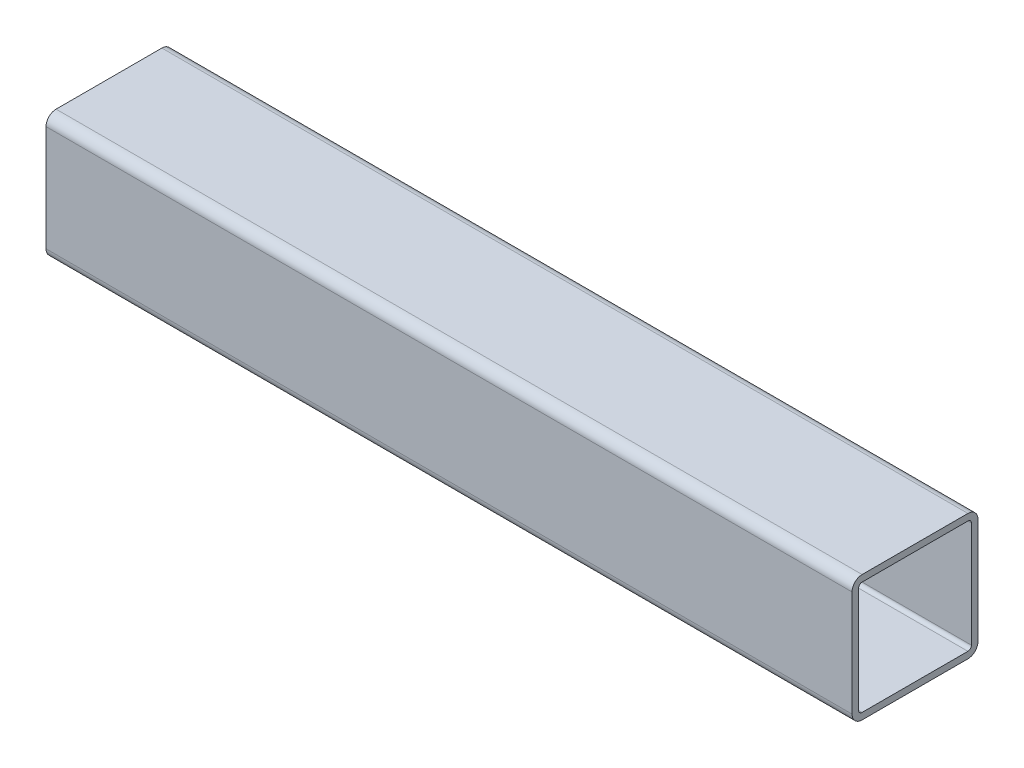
ISO-10303-21;
HEADER;
FILE_DESCRIPTION(('STEP AP214'),'2;1');
FILE_NAME('part.step','',(''),(''),'','','');
FILE_SCHEMA(('AUTOMOTIVE_DESIGN { 1 0 10303 214 1 1 1 1 }'));
ENDSEC;
DATA;
#1=APPLICATION_CONTEXT('core data for automotive mechanical design processes');
#2=APPLICATION_PROTOCOL_DEFINITION('international standard','automotive_design',2000,#1);
#3=PRODUCT_CONTEXT('',#1,'mechanical');
#4=PRODUCT('Part','Part','',(#3));
#5=PRODUCT_RELATED_PRODUCT_CATEGORY('part','',(#4));
#6=PRODUCT_DEFINITION_FORMATION('','',#4);
#7=PRODUCT_DEFINITION_CONTEXT('part definition',#1,'design');
#8=PRODUCT_DEFINITION('design','',#6,#7);
#9=PRODUCT_DEFINITION_SHAPE('','',#8);
#10=(LENGTH_UNIT() NAMED_UNIT(*) SI_UNIT(.MILLI.,.METRE.));
#11=(NAMED_UNIT(*) PLANE_ANGLE_UNIT() SI_UNIT($,.RADIAN.));
#12=(NAMED_UNIT(*) SI_UNIT($,.STERADIAN.) SOLID_ANGLE_UNIT());
#13=UNCERTAINTY_MEASURE_WITH_UNIT(LENGTH_MEASURE(1.E-05),#10,'distance_accuracy_value','');
#14=(GEOMETRIC_REPRESENTATION_CONTEXT(3) GLOBAL_UNCERTAINTY_ASSIGNED_CONTEXT((#13)) GLOBAL_UNIT_ASSIGNED_CONTEXT((#10,
#11,#12)) REPRESENTATION_CONTEXT('',''));
#15=CARTESIAN_POINT('',(0.,0.,0.));
#16=DIRECTION('',(0.,0.,1.));
#17=DIRECTION('',(1.,0.,0.));
#18=AXIS2_PLACEMENT_3D('',#15,#16,#17);
#19=CARTESIAN_POINT('',(203.2,2.54,29.21));
#20=DIRECTION('',(1.,0.,0.));
#21=DIRECTION('',(0.,0.,-1.));
#22=AXIS2_PLACEMENT_3D('',#19,#20,#21);
#23=PLANE('',#22);
#24=CARTESIAN_POINT('',(203.2,2.54,29.21));
#25=DIRECTION('',(1.,0.,0.));
#26=DIRECTION('',(0.,0.,-1.));
#27=AXIS2_PLACEMENT_3D('',#24,#25,#26);
#28=CIRCLE('',#27,2.54);
#29=CARTESIAN_POINT('',(203.2,2.54000000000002,31.75));
#30=VERTEX_POINT('',#29);
#31=CARTESIAN_POINT('',(203.2,0.,29.21));
#32=VERTEX_POINT('',#31);
#33=EDGE_CURVE('E217',#30,#32,#28,.T.);
#34=ORIENTED_EDGE('',*,*,#33,.T.);
#35=DIRECTION('',(0.,0.,-1.));
#36=VECTOR('',#35,1.);
#37=CARTESIAN_POINT('',(203.2,0.,29.21));
#38=LINE('',#37,#36);
#39=CARTESIAN_POINT('',(203.2,0.,2.54000000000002));
#40=VERTEX_POINT('',#39);
#41=EDGE_CURVE('E220',#32,#40,#38,.T.);
#42=ORIENTED_EDGE('',*,*,#41,.T.);
#43=CARTESIAN_POINT('',(203.2,2.54,2.54));
#44=DIRECTION('',(1.,0.,0.));
#45=DIRECTION('',(0.,0.,1.));
#46=AXIS2_PLACEMENT_3D('',#43,#44,#45);
#47=CIRCLE('',#46,2.54);
#48=CARTESIAN_POINT('',(203.2,2.54000000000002,0.));
#49=VERTEX_POINT('',#48);
#50=EDGE_CURVE('E223',#40,#49,#47,.T.);
#51=ORIENTED_EDGE('',*,*,#50,.T.);
#52=DIRECTION('',(0.,1.,0.));
#53=VECTOR('',#52,1.);
#54=CARTESIAN_POINT('',(203.2,2.54000000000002,0.));
#55=LINE('',#54,#53);
#56=CARTESIAN_POINT('',(203.2,29.21,0.));
#57=VERTEX_POINT('',#56);
#58=EDGE_CURVE('E225',#49,#57,#55,.T.);
#59=ORIENTED_EDGE('',*,*,#58,.T.);
#60=CARTESIAN_POINT('',(203.2,29.21,2.54));
#61=DIRECTION('',(1.,0.,0.));
#62=DIRECTION('',(0.,0.,-1.));
#63=AXIS2_PLACEMENT_3D('',#60,#61,#62);
#64=CIRCLE('',#63,2.54);
#65=CARTESIAN_POINT('',(203.2,31.75,2.54000000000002));
#66=VERTEX_POINT('',#65);
#67=EDGE_CURVE('E227',#57,#66,#64,.T.);
#68=ORIENTED_EDGE('',*,*,#67,.T.);
#69=DIRECTION('',(0.,0.,1.));
#70=VECTOR('',#69,1.);
#71=CARTESIAN_POINT('',(203.2,31.75,2.54000000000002));
#72=LINE('',#71,#70);
#73=CARTESIAN_POINT('',(203.2,31.75,29.21));
#74=VERTEX_POINT('',#73);
#75=EDGE_CURVE('E229',#66,#74,#72,.T.);
#76=ORIENTED_EDGE('',*,*,#75,.T.);
#77=CARTESIAN_POINT('',(203.2,29.21,29.21));
#78=DIRECTION('',(1.,0.,0.));
#79=DIRECTION('',(0.,0.,1.));
#80=AXIS2_PLACEMENT_3D('',#77,#78,#79);
#81=CIRCLE('',#80,2.54);
#82=CARTESIAN_POINT('',(203.2,29.21,31.75));
#83=VERTEX_POINT('',#82);
#84=EDGE_CURVE('E231',#74,#83,#81,.T.);
#85=ORIENTED_EDGE('',*,*,#84,.T.);
#86=DIRECTION('',(0.,-1.,0.));
#87=VECTOR('',#86,1.);
#88=CARTESIAN_POINT('',(203.2,29.21,31.75));
#89=LINE('',#88,#87);
#90=EDGE_CURVE('E233',#83,#30,#89,.T.);
#91=ORIENTED_EDGE('',*,*,#90,.T.);
#92=EDGE_LOOP('',(#34,#42,#51,#59,#68,#76,#85,#91));
#93=FACE_BOUND('',#92,.T.);
#94=DIRECTION('',(0.,1.,0.));
#95=VECTOR('',#94,1.);
#96=CARTESIAN_POINT('',(203.2,2.54000000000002,1.651));
#97=LINE('',#96,#95);
#98=CARTESIAN_POINT('',(203.2,2.54000000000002,1.651));
#99=VERTEX_POINT('',#98);
#100=CARTESIAN_POINT('',(203.2,29.21,1.651));
#101=VERTEX_POINT('',#100);
#102=EDGE_CURVE('E160',#99,#101,#97,.T.);
#103=ORIENTED_EDGE('',*,*,#102,.F.);
#104=CARTESIAN_POINT('',(203.2,2.54,2.54));
#105=DIRECTION('',(1.,0.,0.));
#106=DIRECTION('',(0.,0.,1.));
#107=AXIS2_PLACEMENT_3D('',#104,#105,#106);
#108=CIRCLE('',#107,0.889);
#109=CARTESIAN_POINT('',(203.2,1.651,2.54000000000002));
#110=VERTEX_POINT('',#109);
#111=EDGE_CURVE('E152',#110,#99,#108,.T.);
#112=ORIENTED_EDGE('',*,*,#111,.F.);
#113=DIRECTION('',(0.,0.,-1.));
#114=VECTOR('',#113,1.);
#115=CARTESIAN_POINT('',(203.2,1.651,29.21));
#116=LINE('',#115,#114);
#117=CARTESIAN_POINT('',(203.2,1.651,29.21));
#118=VERTEX_POINT('',#117);
#119=EDGE_CURVE('E185',#118,#110,#116,.T.);
#120=ORIENTED_EDGE('',*,*,#119,.F.);
#121=CARTESIAN_POINT('',(203.2,2.54,29.21));
#122=DIRECTION('',(1.,0.,0.));
#123=DIRECTION('',(0.,0.,-1.));
#124=AXIS2_PLACEMENT_3D('',#121,#122,#123);
#125=CIRCLE('',#124,0.889000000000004);
#126=CARTESIAN_POINT('',(203.2,2.54000000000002,30.099));
#127=VERTEX_POINT('',#126);
#128=EDGE_CURVE('E183',#127,#118,#125,.T.);
#129=ORIENTED_EDGE('',*,*,#128,.F.);
#130=DIRECTION('',(0.,-1.,0.));
#131=VECTOR('',#130,1.);
#132=CARTESIAN_POINT('',(203.2,29.21,30.099));
#133=LINE('',#132,#131);
#134=CARTESIAN_POINT('',(203.2,29.21,30.099));
#135=VERTEX_POINT('',#134);
#136=EDGE_CURVE('E181',#135,#127,#133,.T.);
#137=ORIENTED_EDGE('',*,*,#136,.F.);
#138=CARTESIAN_POINT('',(203.2,29.21,29.21));
#139=DIRECTION('',(1.,0.,0.));
#140=DIRECTION('',(0.,0.,1.));
#141=AXIS2_PLACEMENT_3D('',#138,#139,#140);
#142=CIRCLE('',#141,0.889000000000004);
#143=CARTESIAN_POINT('',(203.2,30.099,29.21));
#144=VERTEX_POINT('',#143);
#145=EDGE_CURVE('E179',#144,#135,#142,.T.);
#146=ORIENTED_EDGE('',*,*,#145,.F.);
#147=DIRECTION('',(0.,0.,1.));
#148=VECTOR('',#147,1.);
#149=CARTESIAN_POINT('',(203.2,30.099,2.54000000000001));
#150=LINE('',#149,#148);
#151=CARTESIAN_POINT('',(203.2,30.099,2.54000000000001));
#152=VERTEX_POINT('',#151);
#153=EDGE_CURVE('E175',#152,#144,#150,.T.);
#154=ORIENTED_EDGE('',*,*,#153,.F.);
#155=CARTESIAN_POINT('',(203.2,29.21,2.54));
#156=DIRECTION('',(1.,0.,0.));
#157=DIRECTION('',(0.,0.,-1.));
#158=AXIS2_PLACEMENT_3D('',#155,#156,#157);
#159=CIRCLE('',#158,0.889);
#160=EDGE_CURVE('E173',#101,#152,#159,.T.);
#161=ORIENTED_EDGE('',*,*,#160,.F.);
#162=EDGE_LOOP('',(#103,#112,#120,#129,#137,#146,#154,#161));
#163=FACE_BOUND('',#162,.T.);
#164=ADVANCED_FACE('F39',(#93,#163),#23,.T.);
#165=CARTESIAN_POINT('',(0.,2.54,29.21));
#166=DIRECTION('',(1.,0.,0.));
#167=DIRECTION('',(0.,0.,-1.));
#168=AXIS2_PLACEMENT_3D('',#165,#166,#167);
#169=PLANE('',#168);
#170=CARTESIAN_POINT('',(0.,2.54,29.21));
#171=DIRECTION('',(1.,0.,0.));
#172=DIRECTION('',(0.,0.,-1.));
#173=AXIS2_PLACEMENT_3D('',#170,#171,#172);
#174=CIRCLE('',#173,2.54);
#175=CARTESIAN_POINT('',(0.,2.54000000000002,31.75));
#176=VERTEX_POINT('',#175);
#177=CARTESIAN_POINT('',(0.,0.,29.21));
#178=VERTEX_POINT('',#177);
#179=EDGE_CURVE('E168',#176,#178,#174,.T.);
#180=ORIENTED_EDGE('',*,*,#179,.F.);
#181=DIRECTION('',(0.,-1.,0.));
#182=VECTOR('',#181,1.);
#183=CARTESIAN_POINT('',(0.,29.21,31.75));
#184=LINE('',#183,#182);
#185=CARTESIAN_POINT('',(0.,29.21,31.75));
#186=VERTEX_POINT('',#185);
#187=EDGE_CURVE('E221',#186,#176,#184,.T.);
#188=ORIENTED_EDGE('',*,*,#187,.F.);
#189=CARTESIAN_POINT('',(0.,29.21,29.21));
#190=DIRECTION('',(1.,0.,0.));
#191=DIRECTION('',(0.,0.,1.));
#192=AXIS2_PLACEMENT_3D('',#189,#190,#191);
#193=CIRCLE('',#192,2.54);
#194=CARTESIAN_POINT('',(0.,31.75,29.21));
#195=VERTEX_POINT('',#194);
#196=EDGE_CURVE('E248',#195,#186,#193,.T.);
#197=ORIENTED_EDGE('',*,*,#196,.F.);
#198=DIRECTION('',(0.,0.,1.));
#199=VECTOR('',#198,1.);
#200=CARTESIAN_POINT('',(0.,31.75,2.54000000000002));
#201=LINE('',#200,#199);
#202=CARTESIAN_POINT('',(0.,31.75,2.54000000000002));
#203=VERTEX_POINT('',#202);
#204=EDGE_CURVE('E246',#203,#195,#201,.T.);
#205=ORIENTED_EDGE('',*,*,#204,.F.);
#206=CARTESIAN_POINT('',(0.,29.21,2.54));
#207=DIRECTION('',(1.,0.,0.));
#208=DIRECTION('',(0.,0.,-1.));
#209=AXIS2_PLACEMENT_3D('',#206,#207,#208);
#210=CIRCLE('',#209,2.54);
#211=CARTESIAN_POINT('',(0.,29.21,0.));
#212=VERTEX_POINT('',#211);
#213=EDGE_CURVE('E244',#212,#203,#210,.T.);
#214=ORIENTED_EDGE('',*,*,#213,.F.);
#215=DIRECTION('',(0.,1.,0.));
#216=VECTOR('',#215,1.);
#217=CARTESIAN_POINT('',(0.,2.54000000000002,0.));
#218=LINE('',#217,#216);
#219=CARTESIAN_POINT('',(0.,2.54000000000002,0.));
#220=VERTEX_POINT('',#219);
#221=EDGE_CURVE('E242',#220,#212,#218,.T.);
#222=ORIENTED_EDGE('',*,*,#221,.F.);
#223=CARTESIAN_POINT('',(0.,2.54,2.54));
#224=DIRECTION('',(1.,0.,0.));
#225=DIRECTION('',(0.,0.,1.));
#226=AXIS2_PLACEMENT_3D('',#223,#224,#225);
#227=CIRCLE('',#226,2.54);
#228=CARTESIAN_POINT('',(0.,0.,2.54000000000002));
#229=VERTEX_POINT('',#228);
#230=EDGE_CURVE('E240',#229,#220,#227,.T.);
#231=ORIENTED_EDGE('',*,*,#230,.F.);
#232=DIRECTION('',(0.,0.,-1.));
#233=VECTOR('',#232,1.);
#234=CARTESIAN_POINT('',(0.,0.,29.21));
#235=LINE('',#234,#233);
#236=EDGE_CURVE('E238',#178,#229,#235,.T.);
#237=ORIENTED_EDGE('',*,*,#236,.F.);
#238=EDGE_LOOP('',(#180,#188,#197,#205,#214,#222,#231,#237));
#239=FACE_BOUND('',#238,.T.);
#240=CARTESIAN_POINT('',(0.,2.54,2.54));
#241=DIRECTION('',(1.,0.,0.));
#242=DIRECTION('',(0.,0.,1.));
#243=AXIS2_PLACEMENT_3D('',#240,#241,#242);
#244=CIRCLE('',#243,0.889);
#245=CARTESIAN_POINT('',(0.,1.651,2.54000000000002));
#246=VERTEX_POINT('',#245);
#247=CARTESIAN_POINT('',(0.,2.54000000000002,1.651));
#248=VERTEX_POINT('',#247);
#249=EDGE_CURVE('E62',#246,#248,#244,.T.);
#250=ORIENTED_EDGE('',*,*,#249,.T.);
#251=DIRECTION('',(0.,1.,0.));
#252=VECTOR('',#251,1.);
#253=CARTESIAN_POINT('',(0.,2.54000000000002,1.651));
#254=LINE('',#253,#252);
#255=CARTESIAN_POINT('',(0.,29.21,1.651));
#256=VERTEX_POINT('',#255);
#257=EDGE_CURVE('E167',#248,#256,#254,.T.);
#258=ORIENTED_EDGE('',*,*,#257,.T.);
#259=CARTESIAN_POINT('',(0.,29.21,2.54));
#260=DIRECTION('',(1.,0.,0.));
#261=DIRECTION('',(0.,0.,-1.));
#262=AXIS2_PLACEMENT_3D('',#259,#260,#261);
#263=CIRCLE('',#262,0.889);
#264=CARTESIAN_POINT('',(0.,30.099,2.54000000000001));
#265=VERTEX_POINT('',#264);
#266=EDGE_CURVE('E189',#256,#265,#263,.T.);
#267=ORIENTED_EDGE('',*,*,#266,.T.);
#268=DIRECTION('',(0.,0.,1.));
#269=VECTOR('',#268,1.);
#270=CARTESIAN_POINT('',(0.,30.099,2.54000000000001));
#271=LINE('',#270,#269);
#272=CARTESIAN_POINT('',(0.,30.099,29.21));
#273=VERTEX_POINT('',#272);
#274=EDGE_CURVE('E192',#265,#273,#271,.T.);
#275=ORIENTED_EDGE('',*,*,#274,.T.);
#276=CARTESIAN_POINT('',(0.,29.21,29.21));
#277=DIRECTION('',(1.,0.,0.));
#278=DIRECTION('',(0.,0.,1.));
#279=AXIS2_PLACEMENT_3D('',#276,#277,#278);
#280=CIRCLE('',#279,0.889000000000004);
#281=CARTESIAN_POINT('',(0.,29.21,30.099));
#282=VERTEX_POINT('',#281);
#283=EDGE_CURVE('E195',#273,#282,#280,.T.);
#284=ORIENTED_EDGE('',*,*,#283,.T.);
#285=DIRECTION('',(0.,-1.,0.));
#286=VECTOR('',#285,1.);
#287=CARTESIAN_POINT('',(0.,29.21,30.099));
#288=LINE('',#287,#286);
#289=CARTESIAN_POINT('',(0.,2.54000000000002,30.099));
#290=VERTEX_POINT('',#289);
#291=EDGE_CURVE('E198',#282,#290,#288,.T.);
#292=ORIENTED_EDGE('',*,*,#291,.T.);
#293=CARTESIAN_POINT('',(0.,2.54,29.21));
#294=DIRECTION('',(1.,0.,0.));
#295=DIRECTION('',(0.,0.,-1.));
#296=AXIS2_PLACEMENT_3D('',#293,#294,#295);
#297=CIRCLE('',#296,0.889000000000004);
#298=CARTESIAN_POINT('',(0.,1.651,29.21));
#299=VERTEX_POINT('',#298);
#300=EDGE_CURVE('E201',#290,#299,#297,.T.);
#301=ORIENTED_EDGE('',*,*,#300,.T.);
#302=DIRECTION('',(0.,0.,-1.));
#303=VECTOR('',#302,1.);
#304=CARTESIAN_POINT('',(0.,1.651,29.21));
#305=LINE('',#304,#303);
#306=EDGE_CURVE('E161',#299,#246,#305,.T.);
#307=ORIENTED_EDGE('',*,*,#306,.T.);
#308=EDGE_LOOP('',(#250,#258,#267,#275,#284,#292,#301,#307));
#309=FACE_BOUND('',#308,.T.);
#310=ADVANCED_FACE('F278',(#239,#309),#169,.F.);
#311=CARTESIAN_POINT('',(203.2,2.54,29.21));
#312=DIRECTION('',(-1.,0.,0.));
#313=DIRECTION('',(0.,0.,1.));
#314=AXIS2_PLACEMENT_3D('',#311,#312,#313);
#315=CYLINDRICAL_SURFACE('',#314,2.54);
#316=ORIENTED_EDGE('',*,*,#179,.T.);
#317=DIRECTION('',(-1.,0.,0.));
#318=VECTOR('',#317,1.);
#319=CARTESIAN_POINT('',(203.2,0.,29.21));
#320=LINE('',#319,#318);
#321=EDGE_CURVE('E11',#32,#178,#320,.T.);
#322=ORIENTED_EDGE('',*,*,#321,.F.);
#323=ORIENTED_EDGE('',*,*,#33,.F.);
#324=DIRECTION('',(-1.,0.,0.));
#325=VECTOR('',#324,1.);
#326=CARTESIAN_POINT('',(203.2,2.54000000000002,31.75));
#327=LINE('',#326,#325);
#328=EDGE_CURVE('E235',#30,#176,#327,.T.);
#329=ORIENTED_EDGE('',*,*,#328,.T.);
#330=EDGE_LOOP('',(#316,#322,#323,#329));
#331=FACE_BOUND('',#330,.T.);
#332=ADVANCED_FACE('F41',(#331),#315,.T.);
#333=CARTESIAN_POINT('',(203.2,0.,29.21));
#334=DIRECTION('',(0.,1.,0.));
#335=DIRECTION('',(0.,0.,1.));
#336=AXIS2_PLACEMENT_3D('',#333,#334,#335);
#337=PLANE('',#336);
#338=ORIENTED_EDGE('',*,*,#236,.T.);
#339=DIRECTION('',(-1.,0.,0.));
#340=VECTOR('',#339,1.);
#341=CARTESIAN_POINT('',(203.2,0.,2.54000000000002));
#342=LINE('',#341,#340);
#343=EDGE_CURVE('E47',#40,#229,#342,.T.);
#344=ORIENTED_EDGE('',*,*,#343,.F.);
#345=ORIENTED_EDGE('',*,*,#41,.F.);
#346=ORIENTED_EDGE('',*,*,#321,.T.);
#347=EDGE_LOOP('',(#338,#344,#345,#346));
#348=FACE_BOUND('',#347,.T.);
#349=ADVANCED_FACE('F295',(#348),#337,.F.);
#350=CARTESIAN_POINT('',(203.2,2.54,2.54));
#351=DIRECTION('',(-1.,0.,0.));
#352=DIRECTION('',(0.,0.,1.));
#353=AXIS2_PLACEMENT_3D('',#350,#351,#352);
#354=CYLINDRICAL_SURFACE('',#353,2.54);
#355=ORIENTED_EDGE('',*,*,#230,.T.);
#356=DIRECTION('',(-1.,0.,0.));
#357=VECTOR('',#356,1.);
#358=CARTESIAN_POINT('',(203.2,2.54000000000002,0.));
#359=LINE('',#358,#357);
#360=EDGE_CURVE('E265',#49,#220,#359,.T.);
#361=ORIENTED_EDGE('',*,*,#360,.F.);
#362=ORIENTED_EDGE('',*,*,#50,.F.);
#363=ORIENTED_EDGE('',*,*,#343,.T.);
#364=EDGE_LOOP('',(#355,#361,#362,#363));
#365=FACE_BOUND('',#364,.T.);
#366=ADVANCED_FACE('F272',(#365),#354,.T.);
#367=CARTESIAN_POINT('',(203.2,2.54000000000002,0.));
#368=DIRECTION('',(0.,0.,1.));
#369=DIRECTION('',(1.,0.,0.));
#370=AXIS2_PLACEMENT_3D('',#367,#368,#369);
#371=PLANE('',#370);
#372=ORIENTED_EDGE('',*,*,#221,.T.);
#373=DIRECTION('',(-1.,0.,0.));
#374=VECTOR('',#373,1.);
#375=CARTESIAN_POINT('',(203.2,29.21,0.));
#376=LINE('',#375,#374);
#377=EDGE_CURVE('E262',#57,#212,#376,.T.);
#378=ORIENTED_EDGE('',*,*,#377,.F.);
#379=ORIENTED_EDGE('',*,*,#58,.F.);
#380=ORIENTED_EDGE('',*,*,#360,.T.);
#381=EDGE_LOOP('',(#372,#378,#379,#380));
#382=FACE_BOUND('',#381,.T.);
#383=ADVANCED_FACE('F284',(#382),#371,.F.);
#384=CARTESIAN_POINT('',(203.2,29.21,2.54));
#385=DIRECTION('',(-1.,0.,0.));
#386=DIRECTION('',(0.,0.,1.));
#387=AXIS2_PLACEMENT_3D('',#384,#385,#386);
#388=CYLINDRICAL_SURFACE('',#387,2.54);
#389=ORIENTED_EDGE('',*,*,#213,.T.);
#390=DIRECTION('',(-1.,0.,0.));
#391=VECTOR('',#390,1.);
#392=CARTESIAN_POINT('',(203.2,31.75,2.54000000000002));
#393=LINE('',#392,#391);
#394=EDGE_CURVE('E259',#66,#203,#393,.T.);
#395=ORIENTED_EDGE('',*,*,#394,.F.);
#396=ORIENTED_EDGE('',*,*,#67,.F.);
#397=ORIENTED_EDGE('',*,*,#377,.T.);
#398=EDGE_LOOP('',(#389,#395,#396,#397));
#399=FACE_BOUND('',#398,.T.);
#400=ADVANCED_FACE('F288',(#399),#388,.T.);
#401=CARTESIAN_POINT('',(203.2,31.75,2.54000000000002));
#402=DIRECTION('',(0.,-1.,0.));
#403=DIRECTION('',(0.,0.,-1.));
#404=AXIS2_PLACEMENT_3D('',#401,#402,#403);
#405=PLANE('',#404);
#406=ORIENTED_EDGE('',*,*,#204,.T.);
#407=DIRECTION('',(-1.,0.,0.));
#408=VECTOR('',#407,1.);
#409=CARTESIAN_POINT('',(203.2,31.75,29.21));
#410=LINE('',#409,#408);
#411=EDGE_CURVE('E256',#74,#195,#410,.T.);
#412=ORIENTED_EDGE('',*,*,#411,.F.);
#413=ORIENTED_EDGE('',*,*,#75,.F.);
#414=ORIENTED_EDGE('',*,*,#394,.T.);
#415=EDGE_LOOP('',(#406,#412,#413,#414));
#416=FACE_BOUND('',#415,.T.);
#417=ADVANCED_FACE('F308',(#416),#405,.F.);
#418=CARTESIAN_POINT('',(203.2,29.21,29.21));
#419=DIRECTION('',(-1.,0.,0.));
#420=DIRECTION('',(0.,0.,1.));
#421=AXIS2_PLACEMENT_3D('',#418,#419,#420);
#422=CYLINDRICAL_SURFACE('',#421,2.54);
#423=ORIENTED_EDGE('',*,*,#196,.T.);
#424=DIRECTION('',(-1.,0.,0.));
#425=VECTOR('',#424,1.);
#426=CARTESIAN_POINT('',(203.2,29.21,31.75));
#427=LINE('',#426,#425);
#428=EDGE_CURVE('E253',#83,#186,#427,.T.);
#429=ORIENTED_EDGE('',*,*,#428,.F.);
#430=ORIENTED_EDGE('',*,*,#84,.F.);
#431=ORIENTED_EDGE('',*,*,#411,.T.);
#432=EDGE_LOOP('',(#423,#429,#430,#431));
#433=FACE_BOUND('',#432,.T.);
#434=ADVANCED_FACE('F306',(#433),#422,.T.);
#435=CARTESIAN_POINT('',(203.2,29.21,31.75));
#436=DIRECTION('',(0.,0.,-1.));
#437=DIRECTION('',(0.,1.,0.));
#438=AXIS2_PLACEMENT_3D('',#435,#436,#437);
#439=PLANE('',#438);
#440=ORIENTED_EDGE('',*,*,#187,.T.);
#441=ORIENTED_EDGE('',*,*,#328,.F.);
#442=ORIENTED_EDGE('',*,*,#90,.F.);
#443=ORIENTED_EDGE('',*,*,#428,.T.);
#444=EDGE_LOOP('',(#440,#441,#442,#443));
#445=FACE_BOUND('',#444,.T.);
#446=ADVANCED_FACE('F301',(#445),#439,.F.);
#447=CARTESIAN_POINT('',(203.2,2.54,2.54));
#448=DIRECTION('',(-1.,0.,0.));
#449=DIRECTION('',(0.,0.,1.));
#450=AXIS2_PLACEMENT_3D('',#447,#448,#449);
#451=CYLINDRICAL_SURFACE('',#450,0.889);
#452=ORIENTED_EDGE('',*,*,#249,.F.);
#453=DIRECTION('',(-1.,0.,0.));
#454=VECTOR('',#453,1.);
#455=CARTESIAN_POINT('',(203.2,1.651,2.54000000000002));
#456=LINE('',#455,#454);
#457=EDGE_CURVE('E156',#110,#246,#456,.T.);
#458=ORIENTED_EDGE('',*,*,#457,.F.);
#459=ORIENTED_EDGE('',*,*,#111,.T.);
#460=DIRECTION('',(-1.,0.,0.));
#461=VECTOR('',#460,1.);
#462=CARTESIAN_POINT('',(203.2,2.54000000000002,1.651));
#463=LINE('',#462,#461);
#464=EDGE_CURVE('E155',#99,#248,#463,.T.);
#465=ORIENTED_EDGE('',*,*,#464,.T.);
#466=EDGE_LOOP('',(#452,#458,#459,#465));
#467=FACE_BOUND('',#466,.T.);
#468=ADVANCED_FACE('F154',(#467),#451,.F.);
#469=CARTESIAN_POINT('',(203.2,2.54000000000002,1.651));
#470=DIRECTION('',(0.,0.,1.));
#471=DIRECTION('',(1.,0.,0.));
#472=AXIS2_PLACEMENT_3D('',#469,#470,#471);
#473=PLANE('',#472);
#474=ORIENTED_EDGE('',*,*,#257,.F.);
#475=ORIENTED_EDGE('',*,*,#464,.F.);
#476=ORIENTED_EDGE('',*,*,#102,.T.);
#477=DIRECTION('',(-1.,0.,0.));
#478=VECTOR('',#477,1.);
#479=CARTESIAN_POINT('',(203.2,29.21,1.651));
#480=LINE('',#479,#478);
#481=EDGE_CURVE('E169',#101,#256,#480,.T.);
#482=ORIENTED_EDGE('',*,*,#481,.T.);
#483=EDGE_LOOP('',(#474,#475,#476,#482));
#484=FACE_BOUND('',#483,.T.);
#485=ADVANCED_FACE('F164',(#484),#473,.T.);
#486=CARTESIAN_POINT('',(203.2,29.21,2.54));
#487=DIRECTION('',(-1.,0.,0.));
#488=DIRECTION('',(0.,0.,1.));
#489=AXIS2_PLACEMENT_3D('',#486,#487,#488);
#490=CYLINDRICAL_SURFACE('',#489,0.889);
#491=ORIENTED_EDGE('',*,*,#266,.F.);
#492=ORIENTED_EDGE('',*,*,#481,.F.);
#493=ORIENTED_EDGE('',*,*,#160,.T.);
#494=DIRECTION('',(-1.,0.,0.));
#495=VECTOR('',#494,1.);
#496=CARTESIAN_POINT('',(203.2,30.099,2.54000000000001));
#497=LINE('',#496,#495);
#498=EDGE_CURVE('E214',#152,#265,#497,.T.);
#499=ORIENTED_EDGE('',*,*,#498,.T.);
#500=EDGE_LOOP('',(#491,#492,#493,#499));
#501=FACE_BOUND('',#500,.T.);
#502=ADVANCED_FACE('F333',(#501),#490,.F.);
#503=CARTESIAN_POINT('',(203.2,30.099,2.54000000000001));
#504=DIRECTION('',(0.,-1.,0.));
#505=DIRECTION('',(0.,0.,-1.));
#506=AXIS2_PLACEMENT_3D('',#503,#504,#505);
#507=PLANE('',#506);
#508=ORIENTED_EDGE('',*,*,#274,.F.);
#509=ORIENTED_EDGE('',*,*,#498,.F.);
#510=ORIENTED_EDGE('',*,*,#153,.T.);
#511=DIRECTION('',(-1.,0.,0.));
#512=VECTOR('',#511,1.);
#513=CARTESIAN_POINT('',(203.2,30.099,29.21));
#514=LINE('',#513,#512);
#515=EDGE_CURVE('E212',#144,#273,#514,.T.);
#516=ORIENTED_EDGE('',*,*,#515,.T.);
#517=EDGE_LOOP('',(#508,#509,#510,#516));
#518=FACE_BOUND('',#517,.T.);
#519=ADVANCED_FACE('F337',(#518),#507,.T.);
#520=CARTESIAN_POINT('',(203.2,29.21,29.21));
#521=DIRECTION('',(-1.,0.,0.));
#522=DIRECTION('',(0.,0.,1.));
#523=AXIS2_PLACEMENT_3D('',#520,#521,#522);
#524=CYLINDRICAL_SURFACE('',#523,0.889000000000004);
#525=ORIENTED_EDGE('',*,*,#283,.F.);
#526=ORIENTED_EDGE('',*,*,#515,.F.);
#527=ORIENTED_EDGE('',*,*,#145,.T.);
#528=DIRECTION('',(-1.,0.,0.));
#529=VECTOR('',#528,1.);
#530=CARTESIAN_POINT('',(203.2,29.21,30.099));
#531=LINE('',#530,#529);
#532=EDGE_CURVE('E210',#135,#282,#531,.T.);
#533=ORIENTED_EDGE('',*,*,#532,.T.);
#534=EDGE_LOOP('',(#525,#526,#527,#533));
#535=FACE_BOUND('',#534,.T.);
#536=ADVANCED_FACE('F343',(#535),#524,.F.);
#537=CARTESIAN_POINT('',(203.2,29.21,30.099));
#538=DIRECTION('',(0.,0.,-1.));
#539=DIRECTION('',(-1.,0.,0.));
#540=AXIS2_PLACEMENT_3D('',#537,#538,#539);
#541=PLANE('',#540);
#542=ORIENTED_EDGE('',*,*,#291,.F.);
#543=ORIENTED_EDGE('',*,*,#532,.F.);
#544=ORIENTED_EDGE('',*,*,#136,.T.);
#545=DIRECTION('',(-1.,0.,0.));
#546=VECTOR('',#545,1.);
#547=CARTESIAN_POINT('',(203.2,2.54000000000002,30.099));
#548=LINE('',#547,#546);
#549=EDGE_CURVE('E208',#127,#290,#548,.T.);
#550=ORIENTED_EDGE('',*,*,#549,.T.);
#551=EDGE_LOOP('',(#542,#543,#544,#550));
#552=FACE_BOUND('',#551,.T.);
#553=ADVANCED_FACE('F347',(#552),#541,.T.);
#554=CARTESIAN_POINT('',(203.2,2.54,29.21));
#555=DIRECTION('',(-1.,0.,0.));
#556=DIRECTION('',(0.,0.,1.));
#557=AXIS2_PLACEMENT_3D('',#554,#555,#556);
#558=CYLINDRICAL_SURFACE('',#557,0.889000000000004);
#559=ORIENTED_EDGE('',*,*,#300,.F.);
#560=ORIENTED_EDGE('',*,*,#549,.F.);
#561=ORIENTED_EDGE('',*,*,#128,.T.);
#562=DIRECTION('',(-1.,0.,0.));
#563=VECTOR('',#562,1.);
#564=CARTESIAN_POINT('',(203.2,1.651,29.21));
#565=LINE('',#564,#563);
#566=EDGE_CURVE('E54',#118,#299,#565,.T.);
#567=ORIENTED_EDGE('',*,*,#566,.T.);
#568=EDGE_LOOP('',(#559,#560,#561,#567));
#569=FACE_BOUND('',#568,.T.);
#570=ADVANCED_FACE('F351',(#569),#558,.F.);
#571=CARTESIAN_POINT('',(203.2,1.651,29.21));
#572=DIRECTION('',(0.,1.,0.));
#573=DIRECTION('',(0.,0.,1.));
#574=AXIS2_PLACEMENT_3D('',#571,#572,#573);
#575=PLANE('',#574);
#576=ORIENTED_EDGE('',*,*,#306,.F.);
#577=ORIENTED_EDGE('',*,*,#566,.F.);
#578=ORIENTED_EDGE('',*,*,#119,.T.);
#579=ORIENTED_EDGE('',*,*,#457,.T.);
#580=EDGE_LOOP('',(#576,#577,#578,#579));
#581=FACE_BOUND('',#580,.T.);
#582=ADVANCED_FACE('F355',(#581),#575,.T.);
#583=CLOSED_SHELL('',(#164,#310,#332,#349,#366,#383,#400,#417,#434,#446,#468,#485,#502,#519,
#536,#553,#570,#582));
#584=MANIFOLD_SOLID_BREP('B2',#583);
#585=ADVANCED_BREP_SHAPE_REPRESENTATION('',(#18,#584),#14);
#586=SHAPE_DEFINITION_REPRESENTATION(#9,#585);
ENDSEC;
END-ISO-10303-21;
